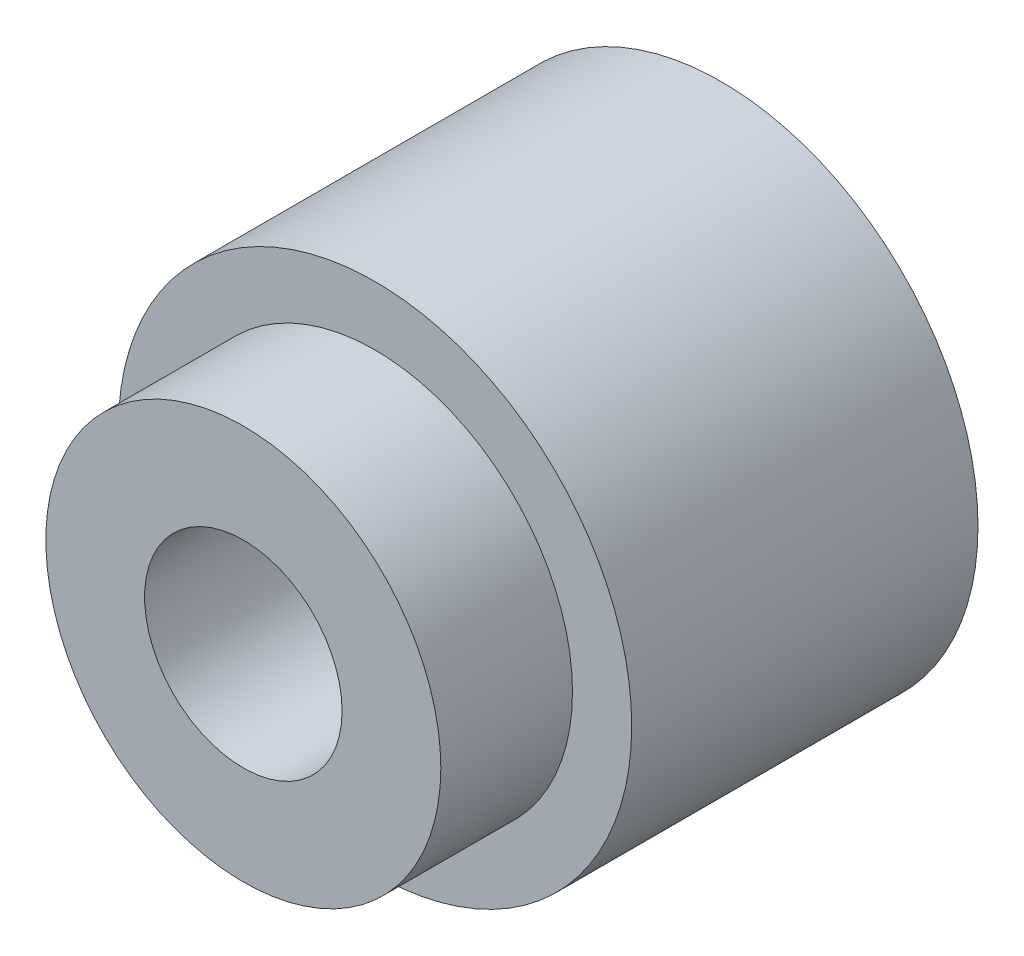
from build123d import *

# Parameters (mm, degrees)
ESQUISSE1_R             = 3.9
BASE_EXTRUSION_DEPTH    = 5.26
ESQUISSE2_R             = 3
BOSS_EXTRU_1_DEPTH      = 2
ESQUISSE3_R             = 1.5
ENL_V_MAT_EXTRU_1_DEPTH = 10.117433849


with BuildPart() as part:
    # Esquisse1 → Base-Extrusion (new body)
    with BuildSketch(Plane.XY):
        Circle(ESQUISSE1_R)
    extrude(amount=-BASE_EXTRUSION_DEPTH)

    # Esquisse2 → Boss.-Extru.1 (add)
    with BuildSketch(Plane.XY):
        Circle(ESQUISSE2_R)
    extrude(amount=BOSS_EXTRU_1_DEPTH)

    # Esquisse3 → Enl_v. mat.-Extru.1 (cut, through all)
    with BuildSketch(Plane.XY.offset(2)):
        Circle(ESQUISSE3_R)
    extrude(amount=-ENL_V_MAT_EXTRU_1_DEPTH, mode=Mode.SUBTRACT)


solid = part.part
